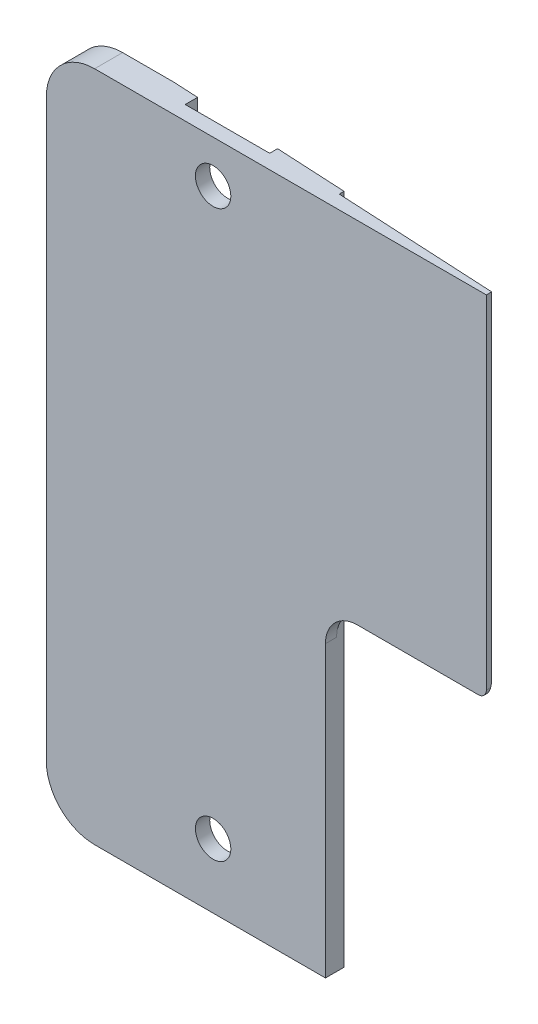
ISO-10303-21;
HEADER;
FILE_DESCRIPTION(('STEP AP214'),'2;1');
FILE_NAME('part.step','',(''),(''),'','','');
FILE_SCHEMA(('AUTOMOTIVE_DESIGN { 1 0 10303 214 1 1 1 1 }'));
ENDSEC;
DATA;
#1=APPLICATION_CONTEXT('core data for automotive mechanical design processes');
#2=APPLICATION_PROTOCOL_DEFINITION('international standard','automotive_design',2000,#1);
#3=PRODUCT_CONTEXT('',#1,'mechanical');
#4=PRODUCT('Part','Part','',(#3));
#5=PRODUCT_RELATED_PRODUCT_CATEGORY('part','',(#4));
#6=PRODUCT_DEFINITION_FORMATION('','',#4);
#7=PRODUCT_DEFINITION_CONTEXT('part definition',#1,'design');
#8=PRODUCT_DEFINITION('design','',#6,#7);
#9=PRODUCT_DEFINITION_SHAPE('','',#8);
#10=(LENGTH_UNIT() NAMED_UNIT(*) SI_UNIT(.MILLI.,.METRE.));
#11=(NAMED_UNIT(*) PLANE_ANGLE_UNIT() SI_UNIT($,.RADIAN.));
#12=(NAMED_UNIT(*) SI_UNIT($,.STERADIAN.) SOLID_ANGLE_UNIT());
#13=UNCERTAINTY_MEASURE_WITH_UNIT(LENGTH_MEASURE(1.E-05),#10,'distance_accuracy_value','');
#14=(GEOMETRIC_REPRESENTATION_CONTEXT(3) GLOBAL_UNCERTAINTY_ASSIGNED_CONTEXT((#13)) GLOBAL_UNIT_ASSIGNED_CONTEXT((#10,
#11,#12)) REPRESENTATION_CONTEXT('',''));
#15=CARTESIAN_POINT('',(0.,0.,0.));
#16=DIRECTION('',(0.,0.,1.));
#17=DIRECTION('',(1.,0.,0.));
#18=AXIS2_PLACEMENT_3D('',#15,#16,#17);
#19=CARTESIAN_POINT('',(0.,-128.652153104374,-6.7));
#20=DIRECTION('',(0.,0.,-1.));
#21=DIRECTION('',(-1.,0.,0.));
#22=AXIS2_PLACEMENT_3D('',#19,#20,#21);
#23=PLANE('',#22);
#24=CARTESIAN_POINT('',(4.64896534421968,-57.3698033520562,-6.7));
#25=DIRECTION('',(0.,0.,1.));
#26=DIRECTION('',(1.,0.,0.));
#27=AXIS2_PLACEMENT_3D('',#24,#25,#26);
#28=CIRCLE('',#27,3.);
#29=CARTESIAN_POINT('',(4.64896534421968,-54.3698033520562,-6.7));
#30=VERTEX_POINT('',#29);
#31=CARTESIAN_POINT('',(1.64896534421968,-57.3698033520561,-6.7));
#32=VERTEX_POINT('',#31);
#33=EDGE_CURVE('E211',#30,#32,#28,.T.);
#34=ORIENTED_EDGE('',*,*,#33,.F.);
#35=DIRECTION('',(-1.,0.,0.));
#36=VECTOR('',#35,1.);
#37=CARTESIAN_POINT('',(4.64896534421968,-54.3698033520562,-6.7));
#38=LINE('',#37,#36);
#39=CARTESIAN_POINT('',(7.83491967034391,-54.3698033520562,-6.70000000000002));
#40=VERTEX_POINT('',#39);
#41=EDGE_CURVE('E222',#40,#30,#38,.T.);
#42=ORIENTED_EDGE('',*,*,#41,.F.);
#43=DIRECTION('',(0.,1.,0.));
#44=VECTOR('',#43,1.);
#45=CARTESIAN_POINT('',(7.8349196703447,-128.652153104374,-6.7));
#46=LINE('',#45,#44);
#47=CARTESIAN_POINT('',(7.83491967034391,-96.145,-6.70000000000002));
#48=VERTEX_POINT('',#47);
#49=EDGE_CURVE('E254',#48,#40,#46,.T.);
#50=ORIENTED_EDGE('',*,*,#49,.F.);
#51=DIRECTION('',(1.,0.,0.));
#52=VECTOR('',#51,1.);
#53=CARTESIAN_POINT('',(4.64896534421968,-96.145,-6.7));
#54=LINE('',#53,#52);
#55=CARTESIAN_POINT('',(4.64896534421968,-96.145,-6.7));
#56=VERTEX_POINT('',#55);
#57=EDGE_CURVE('E220',#56,#48,#54,.T.);
#58=ORIENTED_EDGE('',*,*,#57,.F.);
#59=CARTESIAN_POINT('',(4.64896534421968,-93.145,-6.7));
#60=DIRECTION('',(0.,0.,1.));
#61=DIRECTION('',(-1.,0.,0.));
#62=AXIS2_PLACEMENT_3D('',#59,#60,#61);
#63=CIRCLE('',#62,3.);
#64=CARTESIAN_POINT('',(1.64896534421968,-93.145,-6.7));
#65=VERTEX_POINT('',#64);
#66=EDGE_CURVE('E217',#65,#56,#63,.T.);
#67=ORIENTED_EDGE('',*,*,#66,.F.);
#68=DIRECTION('',(0.,-1.,0.));
#69=VECTOR('',#68,1.);
#70=CARTESIAN_POINT('',(1.64896534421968,-93.145,-6.7));
#71=LINE('',#70,#69);
#72=EDGE_CURVE('E214',#32,#65,#71,.T.);
#73=ORIENTED_EDGE('',*,*,#72,.F.);
#74=EDGE_LOOP('',(#34,#42,#50,#58,#67,#73));
#75=FACE_BOUND('',#74,.T.);
#76=ADVANCED_FACE('F46',(#75),#23,.T.);
#77=CARTESIAN_POINT('',(19.,-128.652153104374,-6.11486293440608));
#78=DIRECTION('',(0.0523359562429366,0.,-0.998629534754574));
#79=DIRECTION('',(-0.998629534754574,0.,-0.0523359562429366));
#80=AXIS2_PLACEMENT_3D('',#77,#78,#79);
#81=PLANE('',#80);
#82=CARTESIAN_POINT('',(12.015,-92.145,-6.48093127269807));
#83=DIRECTION('',(0.0523359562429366,0.,-0.998629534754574));
#84=DIRECTION('',(-0.998629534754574,0.,-0.0523359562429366));
#85=AXIS2_PLACEMENT_3D('',#82,#83,#84);
#86=ELLIPSE('',#85,2.62860240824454,2.625);
#87=CARTESIAN_POINT('',(9.39000000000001,-92.145,-6.61850169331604));
#88=VERTEX_POINT('',#87);
#89=EDGE_CURVE('E210',#88,#88,#86,.T.);
#90=ORIENTED_EDGE('',*,*,#89,.F.);
#91=EDGE_LOOP('',(#90));
#92=FACE_BOUND('',#91,.T.);
#93=DIRECTION('',(0.,-1.,0.));
#94=VECTOR('',#93,1.);
#95=CARTESIAN_POINT('',(14.64,-128.652153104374,-6.34336085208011));
#96=LINE('',#95,#94);
#97=CARTESIAN_POINT('',(14.64,-54.3698033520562,-6.34336085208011));
#98=VERTEX_POINT('',#97);
#99=CARTESIAN_POINT('',(14.64,-57.,-6.34336085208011));
#100=VERTEX_POINT('',#99);
#101=EDGE_CURVE('E208',#98,#100,#96,.T.);
#102=ORIENTED_EDGE('',*,*,#101,.F.);
#103=DIRECTION('',(0.998629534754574,0.,0.0523359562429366));
#104=VECTOR('',#103,1.);
#105=CARTESIAN_POINT('',(19.,-54.3698033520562,-6.11486293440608));
#106=LINE('',#105,#104);
#107=CARTESIAN_POINT('',(19.,-54.3698033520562,-6.11486293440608));
#108=VERTEX_POINT('',#107);
#109=EDGE_CURVE('E249',#98,#108,#106,.T.);
#110=ORIENTED_EDGE('',*,*,#109,.T.);
#111=DIRECTION('',(0.,1.,0.));
#112=VECTOR('',#111,1.);
#113=CARTESIAN_POINT('',(19.,-128.652153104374,-6.11486293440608));
#114=LINE('',#113,#112);
#115=CARTESIAN_POINT('',(19.,-96.145,-6.11486293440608));
#116=VERTEX_POINT('',#115);
#117=EDGE_CURVE('E258',#116,#108,#114,.T.);
#118=ORIENTED_EDGE('',*,*,#117,.F.);
#119=DIRECTION('',(-0.998629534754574,0.,-0.0523359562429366));
#120=VECTOR('',#119,1.);
#121=CARTESIAN_POINT('',(19.,-96.145,-6.11486293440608));
#122=LINE('',#121,#120);
#123=EDGE_CURVE('E228',#116,#48,#122,.T.);
#124=ORIENTED_EDGE('',*,*,#123,.T.);
#125=ORIENTED_EDGE('',*,*,#49,.T.);
#126=CARTESIAN_POINT('',(9.39000000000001,-54.3698033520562,-6.61850169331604));
#127=VERTEX_POINT('',#126);
#128=EDGE_CURVE('E250',#40,#127,#106,.T.);
#129=ORIENTED_EDGE('',*,*,#128,.T.);
#130=DIRECTION('',(0.,1.,0.));
#131=VECTOR('',#130,1.);
#132=CARTESIAN_POINT('',(9.39000000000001,-128.652153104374,-6.61850169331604));
#133=LINE('',#132,#131);
#134=CARTESIAN_POINT('',(9.39000000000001,-57.,-6.61850169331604));
#135=VERTEX_POINT('',#134);
#136=EDGE_CURVE('E206',#135,#127,#133,.T.);
#137=ORIENTED_EDGE('',*,*,#136,.F.);
#138=CARTESIAN_POINT('',(12.015,-57.,-6.48093127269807));
#139=DIRECTION('',(0.0523359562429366,0.,-0.998629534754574));
#140=DIRECTION('',(-0.998629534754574,0.,-0.0523359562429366));
#141=AXIS2_PLACEMENT_3D('',#138,#139,#140);
#142=ELLIPSE('',#141,2.62860240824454,2.625);
#143=EDGE_CURVE('E174',#100,#135,#142,.T.);
#144=ORIENTED_EDGE('',*,*,#143,.F.);
#145=EDGE_LOOP('',(#102,#110,#118,#124,#125,#129,#137,#144));
#146=FACE_BOUND('',#145,.T.);
#147=ADVANCED_FACE('F397',(#92,#146),#81,.T.);
#148=CARTESIAN_POINT('',(19.,-128.652153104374,-6.11486293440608));
#149=DIRECTION('',(1.,0.,0.));
#150=DIRECTION('',(0.,0.,-1.));
#151=AXIS2_PLACEMENT_3D('',#148,#149,#150);
#152=PLANE('',#151);
#153=DIRECTION('',(0.,1.,0.));
#154=VECTOR('',#153,1.);
#155=CARTESIAN_POINT('',(19.,-128.652153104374,-5.81445123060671));
#156=LINE('',#155,#154);
#157=CARTESIAN_POINT('',(19.,-76.2739600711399,-5.81445123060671));
#158=VERTEX_POINT('',#157);
#159=CARTESIAN_POINT('',(19.,-54.3698033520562,-5.81445123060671));
#160=VERTEX_POINT('',#159);
#161=EDGE_CURVE('E261',#158,#160,#156,.T.);
#162=ORIENTED_EDGE('',*,*,#161,.F.);
#163=CARTESIAN_POINT('',(19.,-78.1450000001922,-5.65329520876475));
#164=CARTESIAN_POINT('',(19.0000017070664,-78.1188909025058,-5.65329499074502));
#165=CARTESIAN_POINT('',(19.0000035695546,-78.0927818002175,-5.65339661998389));
#166=CARTESIAN_POINT('',(19.0000057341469,-78.0405902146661,-5.65380355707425));
#167=CARTESIAN_POINT('',(19.0000060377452,-78.0145077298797,-5.654108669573));
#168=CARTESIAN_POINT('',(19.0000032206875,-77.9622888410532,-5.65492344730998));
#169=CARTESIAN_POINT('',(19.0000000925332,-77.9361524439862,-5.65543355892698));
#170=CARTESIAN_POINT('',(18.9999999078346,-77.8839882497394,-5.65665303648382));
#171=CARTESIAN_POINT('',(19.0000028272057,-77.8579604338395,-5.65736160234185));
#172=CARTESIAN_POINT('',(19.0000055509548,-77.8058697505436,-5.65898095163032));
#173=CARTESIAN_POINT('',(19.0000053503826,-77.7798068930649,-5.65989205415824));
#174=CARTESIAN_POINT('',(19.0000026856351,-77.7275737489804,-5.66191843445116));
#175=CARTESIAN_POINT('',(19.0000002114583,-77.7014034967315,-5.66303459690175));
#176=CARTESIAN_POINT('',(18.9999997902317,-77.6492813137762,-5.66545509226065));
#177=CARTESIAN_POINT('',(19.0000018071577,-77.623329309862,-5.666757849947));
#178=CARTESIAN_POINT('',(19.0000036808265,-77.5713316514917,-5.66956289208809));
#179=CARTESIAN_POINT('',(19.0000035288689,-77.5452860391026,-5.67106595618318));
#180=CARTESIAN_POINT('',(19.0000017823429,-77.4930425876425,-5.67427462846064));
#181=CARTESIAN_POINT('',(19.0000001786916,-77.4668448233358,-5.67598145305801));
#182=CARTESIAN_POINT('',(18.9999998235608,-77.4147925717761,-5.679563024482));
#183=CARTESIAN_POINT('',(19.0000010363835,-77.3889379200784,-5.68143538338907));
#184=CARTESIAN_POINT('',(19.0000021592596,-77.3370660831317,-5.68537662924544));
#185=CARTESIAN_POINT('',(19.000002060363,-77.3110489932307,-5.68744677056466));
#186=CARTESIAN_POINT('',(19.0000010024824,-77.258808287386,-5.69178693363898));
#187=CARTESIAN_POINT('',(19.0000000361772,-77.2325848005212,-5.69405850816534));
#188=CARTESIAN_POINT('',(18.9999999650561,-77.181047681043,-5.69870066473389));
#189=CARTESIAN_POINT('',(19.000000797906,-77.1557335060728,-5.70106523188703));
#190=CARTESIAN_POINT('',(19.000002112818,-77.1048872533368,-5.70598040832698));
#191=CARTESIAN_POINT('',(19.0000025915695,-77.0793553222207,-5.70853253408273));
#192=CARTESIAN_POINT('',(19.000002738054,-77.0280438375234,-5.71382583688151));
#193=CARTESIAN_POINT('',(19.0000023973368,-77.002264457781,-5.71656869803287));
#194=CARTESIAN_POINT('',(19.0000016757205,-76.9504309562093,-5.72224637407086));
#195=CARTESIAN_POINT('',(19.0000012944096,-76.9243770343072,-5.72518301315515));
#196=CARTESIAN_POINT('',(19.0000006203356,-76.8719694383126,-5.73125112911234));
#197=CARTESIAN_POINT('',(19.0000003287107,-76.8456159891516,-5.73438454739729));
#198=CARTESIAN_POINT('',(19.0000002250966,-76.7925863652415,-5.7408488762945));
#199=CARTESIAN_POINT('',(19.0000004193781,-76.765910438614,-5.74418182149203));
#200=CARTESIAN_POINT('',(18.9999996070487,-76.7142586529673,-5.75078699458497));
#201=CARTESIAN_POINT('',(18.9999986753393,-76.6892815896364,-5.75404981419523));
#202=CARTESIAN_POINT('',(18.999996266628,-76.6389958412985,-5.76075217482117));
#203=CARTESIAN_POINT('',(18.9999947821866,-76.6136874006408,-5.76419354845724));
#204=CARTESIAN_POINT('',(18.9999927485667,-76.5627247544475,-5.77125482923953));
#205=CARTESIAN_POINT('',(18.9999922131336,-76.5370708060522,-5.77487659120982));
#206=CARTESIAN_POINT('',(18.9999922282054,-76.48540435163,-5.78230053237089));
#207=CARTESIAN_POINT('',(18.9999927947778,-76.4593921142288,-5.78610458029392));
#208=CARTESIAN_POINT('',(18.999994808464,-76.4069978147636,-5.79389484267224));
#209=CARTESIAN_POINT('',(18.9999962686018,-76.380616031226,-5.7978829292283));
#210=CARTESIAN_POINT('',(18.9999987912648,-76.3274728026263,-5.80604303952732));
#211=CARTESIAN_POINT('',(18.9999998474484,-76.3007116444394,-5.81021693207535));
#212=CARTESIAN_POINT('',(19.0000000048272,-76.2739600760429,-5.81445123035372));
#213=B_SPLINE_CURVE_WITH_KNOTS('',3,(#163,#164,#165,#166,#167,#168,#169,#170,#171,#172,#173,
#174,#175,#176,#177,#178,#179,#180,#181,#182,#183,#184,#185,#186,#187,#188,#189,#190,#191,#192,
#193,#194,#195,#196,#197,#198,#199,#200,#201,#202,#203,#204,#205,#206,#207,#208,#209,#210,#211,
#212),.UNSPECIFIED.,.F.,.F.,(4,2,2,2,2,2,2,2,2,2,2,2,2,2,2,2,2,2,2,2,2,2,2,2,4),(0.,
0.0783271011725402,0.156579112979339,0.235002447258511,0.313114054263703,0.391349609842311,
0.469930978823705,0.547884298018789,0.626150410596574,0.704909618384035,0.782676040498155,
0.860973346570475,0.939937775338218,1.0162103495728,1.0931873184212,1.17096146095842,
1.24961765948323,1.32923440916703,1.40988393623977,1.48545141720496,1.5620751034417,
1.63979980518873,1.71866624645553,1.79871050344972,1.87996428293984),.UNSPECIFIED.);
#214=CARTESIAN_POINT('',(19.,-78.145,-5.65329446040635));
#215=VERTEX_POINT('',#214);
#216=EDGE_CURVE('E334',#158,#215,#213,.F.);
#217=ORIENTED_EDGE('',*,*,#216,.T.);
#218=DIRECTION('',(0.,0.,1.));
#219=VECTOR('',#218,1.);
#220=CARTESIAN_POINT('',(19.,-78.145,-4.96));
#221=LINE('',#220,#219);
#222=CARTESIAN_POINT('',(19.,-78.145,-4.96));
#223=VERTEX_POINT('',#222);
#224=EDGE_CURVE('E494',#215,#223,#221,.T.);
#225=ORIENTED_EDGE('',*,*,#224,.T.);
#226=DIRECTION('',(0.,1.,0.));
#227=VECTOR('',#226,1.);
#228=CARTESIAN_POINT('',(19.,-128.652153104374,-4.96));
#229=LINE('',#228,#227);
#230=CARTESIAN_POINT('',(19.,-96.145,-4.96));
#231=VERTEX_POINT('',#230);
#232=EDGE_CURVE('E482',#231,#223,#229,.T.);
#233=ORIENTED_EDGE('',*,*,#232,.F.);
#234=DIRECTION('',(0.,0.,1.));
#235=VECTOR('',#234,1.);
#236=CARTESIAN_POINT('',(19.,-96.145,-6.7));
#237=LINE('',#236,#235);
#238=EDGE_CURVE('E232',#116,#231,#237,.T.);
#239=ORIENTED_EDGE('',*,*,#238,.F.);
#240=ORIENTED_EDGE('',*,*,#117,.T.);
#241=DIRECTION('',(0.,0.,1.));
#242=VECTOR('',#241,1.);
#243=CARTESIAN_POINT('',(19.,-54.3698033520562,-6.11486293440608));
#244=LINE('',#243,#242);
#245=EDGE_CURVE('E246',#108,#160,#244,.T.);
#246=ORIENTED_EDGE('',*,*,#245,.T.);
#247=EDGE_LOOP('',(#162,#217,#225,#233,#239,#240,#246));
#248=FACE_BOUND('',#247,.T.);
#249=ADVANCED_FACE('F294',(#248),#152,.T.);
#250=CARTESIAN_POINT('',(19.,-128.652153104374,-5.81445123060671));
#251=DIRECTION('',(0.0523359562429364,0.,-0.998629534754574));
#252=DIRECTION('',(-0.998629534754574,0.,-0.0523359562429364));
#253=AXIS2_PLACEMENT_3D('',#250,#251,#252);
#254=PLANE('',#253);
#255=DIRECTION('',(-0.998629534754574,0.,-0.0523359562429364));
#256=VECTOR('',#255,1.);
#257=CARTESIAN_POINT('',(19.,-75.3985898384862,-5.81445123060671));
#258=LINE('',#257,#256);
#259=CARTESIAN_POINT('',(29.,-75.3985898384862,-5.29037343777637));
#260=VERTEX_POINT('',#259);
#261=CARTESIAN_POINT('',(21.0104671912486,-75.3985898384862,-5.70908710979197));
#262=VERTEX_POINT('',#261);
#263=EDGE_CURVE('E281',#260,#262,#258,.T.);
#264=ORIENTED_EDGE('',*,*,#263,.T.);
#265=CARTESIAN_POINT('',(18.2725232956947,-78.3604808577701,-5.85257666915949));
#266=CARTESIAN_POINT('',(18.2577001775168,-78.172322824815,-5.85335351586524));
#267=CARTESIAN_POINT('',(18.2623719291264,-77.9826397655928,-5.85310867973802));
#268=CARTESIAN_POINT('',(18.2984056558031,-77.701831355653,-5.8512202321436));
#269=CARTESIAN_POINT('',(18.3152460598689,-77.6088493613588,-5.85033766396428));
#270=CARTESIAN_POINT('',(18.358405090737,-77.4251103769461,-5.84807579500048));
#271=CARTESIAN_POINT('',(18.3847238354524,-77.3343544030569,-5.84669648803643));
#272=CARTESIAN_POINT('',(18.4465606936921,-77.1560318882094,-5.84345575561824));
#273=CARTESIAN_POINT('',(18.482078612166,-77.068465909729,-5.84159434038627));
#274=CARTESIAN_POINT('',(18.5619367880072,-76.8974530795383,-5.83740915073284));
#275=CARTESIAN_POINT('',(18.60627679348,-76.8140067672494,-5.83508538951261));
#276=CARTESIAN_POINT('',(18.7033084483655,-76.6521192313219,-5.83000017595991));
#277=CARTESIAN_POINT('',(18.7559997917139,-76.5736785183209,-5.82723873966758));
#278=CARTESIAN_POINT('',(18.869174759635,-76.4226350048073,-5.8213074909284));
#279=CARTESIAN_POINT('',(18.929658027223,-76.3500326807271,-5.81813769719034));
#280=CARTESIAN_POINT('',(19.0577747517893,-76.2114367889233,-5.8114233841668));
#281=CARTESIAN_POINT('',(19.1254078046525,-76.145443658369,-5.80787888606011));
#282=CARTESIAN_POINT('',(19.2671060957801,-76.0207668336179,-5.80045279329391));
#283=CARTESIAN_POINT('',(19.3411708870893,-75.9620835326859,-5.79657122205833));
#284=CARTESIAN_POINT('',(19.4949463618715,-75.8526494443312,-5.78851219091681));
#285=CARTESIAN_POINT('',(19.5746565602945,-75.8018990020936,-5.78433475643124));
#286=CARTESIAN_POINT('',(19.7388766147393,-75.7088694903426,-5.77572834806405));
#287=CARTESIAN_POINT('',(19.8233859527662,-75.6665907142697,-5.77129940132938));
#288=CARTESIAN_POINT('',(19.9963070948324,-75.5909534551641,-5.76223698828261));
#289=CARTESIAN_POINT('',(20.0847183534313,-75.557595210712,-5.75760355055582));
#290=CARTESIAN_POINT('',(20.2645047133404,-75.5001532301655,-5.7481813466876));
#291=CARTESIAN_POINT('',(20.3558787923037,-75.4760694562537,-5.74339263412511));
#292=CARTESIAN_POINT('',(20.632994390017,-75.4181148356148,-5.72886962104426));
#293=CARTESIAN_POINT('',(20.8217261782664,-75.3985751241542,-5.71897860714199));
#294=CARTESIAN_POINT('',(21.0104671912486,-75.3985898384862,-5.70908710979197));
#295=B_SPLINE_CURVE_WITH_KNOTS('',3,(#265,#266,#267,#268,#269,#270,#271,#272,#273,#274,#275,
#276,#277,#278,#279,#280,#281,#282,#283,#284,#285,#286,#287,#288,#289,#290,#291,#292,#293,#294),
.UNSPECIFIED.,.F.,.F.,(4,2,2,2,2,2,2,2,2,2,2,2,2,2,4),(-0.0785398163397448,0.127627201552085,
0.230710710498,0.333794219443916,0.436877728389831,0.539961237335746,0.643044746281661,
0.746128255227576,0.849211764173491,0.952295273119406,1.05537878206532,1.15846229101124,
1.26154579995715,1.36462930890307,1.5707963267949),.UNSPECIFIED.);
#296=EDGE_CURVE('E275',#262,#158,#295,.F.);
#297=ORIENTED_EDGE('',*,*,#296,.T.);
#298=ORIENTED_EDGE('',*,*,#161,.T.);
#299=DIRECTION('',(0.998629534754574,0.,0.0523359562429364));
#300=VECTOR('',#299,1.);
#301=CARTESIAN_POINT('',(19.,-54.3698033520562,-5.81445123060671));
#302=LINE('',#301,#300);
#303=CARTESIAN_POINT('',(29.,-54.3698033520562,-5.29037343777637));
#304=VERTEX_POINT('',#303);
#305=EDGE_CURVE('E243',#160,#304,#302,.T.);
#306=ORIENTED_EDGE('',*,*,#305,.T.);
#307=DIRECTION('',(0.,1.,0.));
#308=VECTOR('',#307,1.);
#309=CARTESIAN_POINT('',(29.,-128.652153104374,-5.29037343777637));
#310=LINE('',#309,#308);
#311=EDGE_CURVE('E264',#260,#304,#310,.T.);
#312=ORIENTED_EDGE('',*,*,#311,.F.);
#313=EDGE_LOOP('',(#264,#297,#298,#306,#312));
#314=FACE_BOUND('',#313,.T.);
#315=ADVANCED_FACE('F283',(#314),#254,.T.);
#316=CARTESIAN_POINT('',(29.,-128.652153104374,-4.96));
#317=DIRECTION('',(1.,0.,0.));
#318=DIRECTION('',(0.,0.,-1.));
#319=AXIS2_PLACEMENT_3D('',#316,#317,#318);
#320=PLANE('',#319);
#321=DIRECTION('',(0.,1.,0.));
#322=VECTOR('',#321,1.);
#323=CARTESIAN_POINT('',(29.,-128.652153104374,-4.96));
#324=LINE('',#323,#322);
#325=CARTESIAN_POINT('',(29.,-75.645,-4.96));
#326=VERTEX_POINT('',#325);
#327=CARTESIAN_POINT('',(29.,-54.3698033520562,-4.96));
#328=VERTEX_POINT('',#327);
#329=EDGE_CURVE('E253',#326,#328,#324,.T.);
#330=ORIENTED_EDGE('',*,*,#329,.F.);
#331=DIRECTION('',(0.,0.,1.));
#332=VECTOR('',#331,1.);
#333=CARTESIAN_POINT('',(29.,-75.645,-4.96));
#334=LINE('',#333,#332);
#335=CARTESIAN_POINT('',(29.,-75.645,-5.22425742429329));
#336=VERTEX_POINT('',#335);
#337=EDGE_CURVE('E54',#326,#336,#334,.F.);
#338=ORIENTED_EDGE('',*,*,#337,.T.);
#339=DIRECTION('',(0.,-0.965836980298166,0.259150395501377));
#340=VECTOR('',#339,1.);
#341=CARTESIAN_POINT('',(29.,-125.158392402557,8.0610230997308));
#342=LINE('',#341,#340);
#343=EDGE_CURVE('E329',#336,#260,#342,.F.);
#344=ORIENTED_EDGE('',*,*,#343,.T.);
#345=ORIENTED_EDGE('',*,*,#311,.T.);
#346=DIRECTION('',(0.,0.,1.));
#347=VECTOR('',#346,1.);
#348=CARTESIAN_POINT('',(29.,-54.3698033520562,-6.7));
#349=LINE('',#348,#347);
#350=EDGE_CURVE('E229',#304,#328,#349,.T.);
#351=ORIENTED_EDGE('',*,*,#350,.T.);
#352=EDGE_LOOP('',(#330,#338,#344,#345,#351));
#353=FACE_BOUND('',#352,.T.);
#354=ADVANCED_FACE('F293',(#353),#320,.T.);
#355=CARTESIAN_POINT('',(0.,-128.652153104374,-4.96));
#356=DIRECTION('',(0.,0.,1.));
#357=DIRECTION('',(1.,0.,0.));
#358=AXIS2_PLACEMENT_3D('',#355,#356,#357);
#359=PLANE('',#358);
#360=CARTESIAN_POINT('',(12.015,-57.,-4.96));
#361=DIRECTION('',(0.,0.,-1.));
#362=DIRECTION('',(-1.,0.,0.));
#363=AXIS2_PLACEMENT_3D('',#360,#361,#362);
#364=CIRCLE('',#363,1.1);
#365=CARTESIAN_POINT('',(10.915,-57.,-4.96));
#366=VERTEX_POINT('',#365);
#367=EDGE_CURVE('E190',#366,#366,#364,.T.);
#368=ORIENTED_EDGE('',*,*,#367,.T.);
#369=EDGE_LOOP('',(#368));
#370=FACE_BOUND('',#369,.T.);
#371=CARTESIAN_POINT('',(12.015,-92.145,-4.96));
#372=DIRECTION('',(0.,0.,-1.));
#373=DIRECTION('',(-1.,0.,0.));
#374=AXIS2_PLACEMENT_3D('',#371,#372,#373);
#375=CIRCLE('',#374,1.1);
#376=CARTESIAN_POINT('',(10.915,-92.145,-4.96));
#377=VERTEX_POINT('',#376);
#378=EDGE_CURVE('E460',#377,#377,#375,.T.);
#379=ORIENTED_EDGE('',*,*,#378,.T.);
#380=EDGE_LOOP('',(#379));
#381=FACE_BOUND('',#380,.T.);
#382=DIRECTION('',(1.,0.,0.));
#383=VECTOR('',#382,1.);
#384=CARTESIAN_POINT('',(0.,-76.145,-4.96));
#385=LINE('',#384,#383);
#386=CARTESIAN_POINT('',(21.,-76.145,-4.96));
#387=VERTEX_POINT('',#386);
#388=CARTESIAN_POINT('',(28.5,-76.145,-4.96));
#389=VERTEX_POINT('',#388);
#390=EDGE_CURVE('E475',#387,#389,#385,.T.);
#391=ORIENTED_EDGE('',*,*,#390,.T.);
#392=CARTESIAN_POINT('',(28.5,-75.645,-4.96));
#393=DIRECTION('',(0.,0.,1.));
#394=DIRECTION('',(1.,0.,0.));
#395=AXIS2_PLACEMENT_3D('',#392,#393,#394);
#396=CIRCLE('',#395,0.5);
#397=EDGE_CURVE('E68',#389,#326,#396,.T.);
#398=ORIENTED_EDGE('',*,*,#397,.T.);
#399=ORIENTED_EDGE('',*,*,#329,.T.);
#400=DIRECTION('',(-1.,0.,0.));
#401=VECTOR('',#400,1.);
#402=CARTESIAN_POINT('',(0.,-54.3698033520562,-4.96));
#403=LINE('',#402,#401);
#404=CARTESIAN_POINT('',(4.64896534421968,-54.3698033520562,-4.96));
#405=VERTEX_POINT('',#404);
#406=EDGE_CURVE('E485',#328,#405,#403,.T.);
#407=ORIENTED_EDGE('',*,*,#406,.T.);
#408=CARTESIAN_POINT('',(4.64896534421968,-57.3698033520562,-4.96));
#409=DIRECTION('',(0.,0.,1.));
#410=DIRECTION('',(1.,0.,0.));
#411=AXIS2_PLACEMENT_3D('',#408,#409,#410);
#412=CIRCLE('',#411,3.);
#413=CARTESIAN_POINT('',(1.64896534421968,-57.3698033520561,-4.96));
#414=VERTEX_POINT('',#413);
#415=EDGE_CURVE('E481',#405,#414,#412,.T.);
#416=ORIENTED_EDGE('',*,*,#415,.T.);
#417=DIRECTION('',(0.,-1.,0.));
#418=VECTOR('',#417,1.);
#419=CARTESIAN_POINT('',(1.64896534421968,-128.652153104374,-4.96));
#420=LINE('',#419,#418);
#421=CARTESIAN_POINT('',(1.64896534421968,-93.145,-4.96));
#422=VERTEX_POINT('',#421);
#423=EDGE_CURVE('E257',#414,#422,#420,.T.);
#424=ORIENTED_EDGE('',*,*,#423,.T.);
#425=CARTESIAN_POINT('',(4.64896534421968,-93.145,-4.96));
#426=DIRECTION('',(0.,0.,1.));
#427=DIRECTION('',(1.,0.,0.));
#428=AXIS2_PLACEMENT_3D('',#425,#426,#427);
#429=CIRCLE('',#428,3.);
#430=CARTESIAN_POINT('',(4.64896534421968,-96.145,-4.96));
#431=VERTEX_POINT('',#430);
#432=EDGE_CURVE('E510',#422,#431,#429,.T.);
#433=ORIENTED_EDGE('',*,*,#432,.T.);
#434=DIRECTION('',(1.,0.,0.));
#435=VECTOR('',#434,1.);
#436=CARTESIAN_POINT('',(0.,-96.145,-4.96));
#437=LINE('',#436,#435);
#438=EDGE_CURVE('E487',#431,#231,#437,.T.);
#439=ORIENTED_EDGE('',*,*,#438,.T.);
#440=ORIENTED_EDGE('',*,*,#232,.T.);
#441=CARTESIAN_POINT('',(21.,-78.145,-4.96));
#442=DIRECTION('',(0.,0.,1.));
#443=DIRECTION('',(1.,0.,0.));
#444=AXIS2_PLACEMENT_3D('',#441,#442,#443);
#445=CIRCLE('',#444,2.);
#446=EDGE_CURVE('E269',#223,#387,#445,.F.);
#447=ORIENTED_EDGE('',*,*,#446,.T.);
#448=EDGE_LOOP('',(#391,#398,#399,#407,#416,#424,#433,#439,#440,#447));
#449=FACE_BOUND('',#448,.T.);
#450=ADVANCED_FACE('F299',(#370,#381,#449),#359,.T.);
#451=CARTESIAN_POINT('',(4.64896534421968,-57.3698033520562,-6.7));
#452=DIRECTION('',(0.,0.,1.));
#453=DIRECTION('',(1.,0.,0.));
#454=AXIS2_PLACEMENT_3D('',#451,#452,#453);
#455=CYLINDRICAL_SURFACE('',#454,3.);
#456=DIRECTION('',(0.,0.,1.));
#457=VECTOR('',#456,1.);
#458=CARTESIAN_POINT('',(4.64896534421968,-54.3698033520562,-6.7));
#459=LINE('',#458,#457);
#460=EDGE_CURVE('E225',#30,#405,#459,.T.);
#461=ORIENTED_EDGE('',*,*,#460,.F.);
#462=ORIENTED_EDGE('',*,*,#33,.T.);
#463=DIRECTION('',(0.,0.,1.));
#464=VECTOR('',#463,1.);
#465=CARTESIAN_POINT('',(1.64896534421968,-57.3698033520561,-6.7));
#466=LINE('',#465,#464);
#467=EDGE_CURVE('E224',#32,#414,#466,.T.);
#468=ORIENTED_EDGE('',*,*,#467,.T.);
#469=ORIENTED_EDGE('',*,*,#415,.F.);
#470=EDGE_LOOP('',(#461,#462,#468,#469));
#471=FACE_BOUND('',#470,.T.);
#472=ADVANCED_FACE('F302',(#471),#455,.T.);
#473=CARTESIAN_POINT('',(4.64896534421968,-54.3698033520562,-6.7));
#474=DIRECTION('',(0.,1.,0.));
#475=DIRECTION('',(0.,0.,1.));
#476=AXIS2_PLACEMENT_3D('',#473,#474,#475);
#477=PLANE('',#476);
#478=DIRECTION('',(0.,0.,-1.));
#479=VECTOR('',#478,1.);
#480=CARTESIAN_POINT('',(14.64,-54.3698033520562,-5.85));
#481=LINE('',#480,#479);
#482=CARTESIAN_POINT('',(14.64,-54.3698033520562,-5.85));
#483=VERTEX_POINT('',#482);
#484=EDGE_CURVE('E203',#483,#98,#481,.T.);
#485=ORIENTED_EDGE('',*,*,#484,.F.);
#486=DIRECTION('',(1.,0.,0.));
#487=VECTOR('',#486,1.);
#488=CARTESIAN_POINT('',(9.39000000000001,-54.3698033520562,-5.85));
#489=LINE('',#488,#487);
#490=CARTESIAN_POINT('',(9.39000000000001,-54.3698033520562,-5.85));
#491=VERTEX_POINT('',#490);
#492=EDGE_CURVE('E186',#491,#483,#489,.T.);
#493=ORIENTED_EDGE('',*,*,#492,.F.);
#494=DIRECTION('',(0.,0.,-1.));
#495=VECTOR('',#494,1.);
#496=CARTESIAN_POINT('',(9.39000000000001,-54.3698033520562,-5.85));
#497=LINE('',#496,#495);
#498=EDGE_CURVE('E177',#491,#127,#497,.T.);
#499=ORIENTED_EDGE('',*,*,#498,.T.);
#500=ORIENTED_EDGE('',*,*,#128,.F.);
#501=ORIENTED_EDGE('',*,*,#41,.T.);
#502=ORIENTED_EDGE('',*,*,#460,.T.);
#503=ORIENTED_EDGE('',*,*,#406,.F.);
#504=ORIENTED_EDGE('',*,*,#350,.F.);
#505=ORIENTED_EDGE('',*,*,#305,.F.);
#506=ORIENTED_EDGE('',*,*,#245,.F.);
#507=ORIENTED_EDGE('',*,*,#109,.F.);
#508=EDGE_LOOP('',(#485,#493,#499,#500,#501,#502,#503,#504,#505,#506,#507));
#509=FACE_BOUND('',#508,.T.);
#510=ADVANCED_FACE('F408',(#509),#477,.T.);
#511=CARTESIAN_POINT('',(19.,-76.145,-6.7));
#512=DIRECTION('',(0.,-1.,0.));
#513=DIRECTION('',(0.,0.,-1.));
#514=AXIS2_PLACEMENT_3D('',#511,#512,#513);
#515=PLANE('',#514);
#516=DIRECTION('',(0.998629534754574,0.,0.0523359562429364));
#517=VECTOR('',#516,1.);
#518=CARTESIAN_POINT('',(18.9432502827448,-76.145,-5.6171508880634));
#519=LINE('',#518,#517);
#520=CARTESIAN_POINT('',(21.,-76.145,-5.50936120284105));
#521=VERTEX_POINT('',#520);
#522=CARTESIAN_POINT('',(28.5,-76.145,-5.1163028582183));
#523=VERTEX_POINT('',#522);
#524=EDGE_CURVE('E321',#521,#523,#519,.T.);
#525=ORIENTED_EDGE('',*,*,#524,.T.);
#526=DIRECTION('',(0.,0.,1.));
#527=VECTOR('',#526,1.);
#528=CARTESIAN_POINT('',(28.5,-76.145,-6.7));
#529=LINE('',#528,#527);
#530=EDGE_CURVE('E530',#523,#389,#529,.T.);
#531=ORIENTED_EDGE('',*,*,#530,.T.);
#532=ORIENTED_EDGE('',*,*,#390,.F.);
#533=DIRECTION('',(0.,0.,1.));
#534=VECTOR('',#533,1.);
#535=CARTESIAN_POINT('',(21.,-76.145,-5.81445123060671));
#536=LINE('',#535,#534);
#537=EDGE_CURVE('E500',#387,#521,#536,.F.);
#538=ORIENTED_EDGE('',*,*,#537,.T.);
#539=EDGE_LOOP('',(#525,#531,#532,#538));
#540=FACE_BOUND('',#539,.T.);
#541=ADVANCED_FACE('F421',(#540),#515,.T.);
#542=CARTESIAN_POINT('',(4.64896534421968,-96.145,-6.7));
#543=DIRECTION('',(0.,-1.,0.));
#544=DIRECTION('',(0.,0.,-1.));
#545=AXIS2_PLACEMENT_3D('',#542,#543,#544);
#546=PLANE('',#545);
#547=ORIENTED_EDGE('',*,*,#238,.T.);
#548=ORIENTED_EDGE('',*,*,#438,.F.);
#549=DIRECTION('',(0.,0.,1.));
#550=VECTOR('',#549,1.);
#551=CARTESIAN_POINT('',(4.64896534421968,-96.145,-6.7));
#552=LINE('',#551,#550);
#553=EDGE_CURVE('E234',#56,#431,#552,.T.);
#554=ORIENTED_EDGE('',*,*,#553,.F.);
#555=ORIENTED_EDGE('',*,*,#57,.T.);
#556=ORIENTED_EDGE('',*,*,#123,.F.);
#557=EDGE_LOOP('',(#547,#548,#554,#555,#556));
#558=FACE_BOUND('',#557,.T.);
#559=ADVANCED_FACE('F417',(#558),#546,.T.);
#560=CARTESIAN_POINT('',(4.64896534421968,-93.145,-6.7));
#561=DIRECTION('',(0.,0.,1.));
#562=DIRECTION('',(1.,0.,0.));
#563=AXIS2_PLACEMENT_3D('',#560,#561,#562);
#564=CYLINDRICAL_SURFACE('',#563,3.);
#565=DIRECTION('',(0.,0.,1.));
#566=VECTOR('',#565,1.);
#567=CARTESIAN_POINT('',(1.64896534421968,-93.145,-6.7));
#568=LINE('',#567,#566);
#569=EDGE_CURVE('E237',#65,#422,#568,.T.);
#570=ORIENTED_EDGE('',*,*,#569,.F.);
#571=ORIENTED_EDGE('',*,*,#66,.T.);
#572=ORIENTED_EDGE('',*,*,#553,.T.);
#573=ORIENTED_EDGE('',*,*,#432,.F.);
#574=EDGE_LOOP('',(#570,#571,#572,#573));
#575=FACE_BOUND('',#574,.T.);
#576=ADVANCED_FACE('F413',(#575),#564,.T.);
#577=CARTESIAN_POINT('',(1.64896534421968,-93.145,-6.7));
#578=DIRECTION('',(-1.,0.,0.));
#579=DIRECTION('',(0.,0.,1.));
#580=AXIS2_PLACEMENT_3D('',#577,#578,#579);
#581=PLANE('',#580);
#582=ORIENTED_EDGE('',*,*,#467,.F.);
#583=ORIENTED_EDGE('',*,*,#72,.T.);
#584=ORIENTED_EDGE('',*,*,#569,.T.);
#585=ORIENTED_EDGE('',*,*,#423,.F.);
#586=EDGE_LOOP('',(#582,#583,#584,#585));
#587=FACE_BOUND('',#586,.T.);
#588=ADVANCED_FACE('F410',(#587),#581,.T.);
#589=CARTESIAN_POINT('',(12.015,-57.,-5.85));
#590=DIRECTION('',(0.,0.,-1.));
#591=DIRECTION('',(-1.,0.,0.));
#592=AXIS2_PLACEMENT_3D('',#589,#590,#591);
#593=CYLINDRICAL_SURFACE('',#592,2.625);
#594=ORIENTED_EDGE('',*,*,#143,.T.);
#595=DIRECTION('',(0.,0.,-1.));
#596=VECTOR('',#595,1.);
#597=CARTESIAN_POINT('',(9.39000000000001,-57.,-5.85));
#598=LINE('',#597,#596);
#599=CARTESIAN_POINT('',(9.39000000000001,-57.,-5.85));
#600=VERTEX_POINT('',#599);
#601=EDGE_CURVE('E166',#600,#135,#598,.T.);
#602=ORIENTED_EDGE('',*,*,#601,.F.);
#603=CARTESIAN_POINT('',(12.015,-57.,-5.85));
#604=DIRECTION('',(0.,0.,-1.));
#605=DIRECTION('',(-1.,0.,0.));
#606=AXIS2_PLACEMENT_3D('',#603,#604,#605);
#607=CIRCLE('',#606,2.625);
#608=CARTESIAN_POINT('',(14.64,-57.,-5.85));
#609=VERTEX_POINT('',#608);
#610=EDGE_CURVE('E171',#609,#600,#607,.T.);
#611=ORIENTED_EDGE('',*,*,#610,.F.);
#612=DIRECTION('',(0.,0.,-1.));
#613=VECTOR('',#612,1.);
#614=CARTESIAN_POINT('',(14.64,-57.,-5.85));
#615=LINE('',#614,#613);
#616=EDGE_CURVE('E201',#609,#100,#615,.T.);
#617=ORIENTED_EDGE('',*,*,#616,.T.);
#618=EDGE_LOOP('',(#594,#602,#611,#617));
#619=FACE_BOUND('',#618,.T.);
#620=ADVANCED_FACE('F168',(#619),#593,.F.);
#621=CARTESIAN_POINT('',(14.64,-57.,-5.85));
#622=DIRECTION('',(1.,0.,0.));
#623=DIRECTION('',(0.,0.,-1.));
#624=AXIS2_PLACEMENT_3D('',#621,#622,#623);
#625=PLANE('',#624);
#626=ORIENTED_EDGE('',*,*,#101,.T.);
#627=ORIENTED_EDGE('',*,*,#616,.F.);
#628=DIRECTION('',(0.,-1.,0.));
#629=VECTOR('',#628,1.);
#630=CARTESIAN_POINT('',(14.64,-57.,-5.85));
#631=LINE('',#630,#629);
#632=EDGE_CURVE('E178',#483,#609,#631,.T.);
#633=ORIENTED_EDGE('',*,*,#632,.F.);
#634=ORIENTED_EDGE('',*,*,#484,.T.);
#635=EDGE_LOOP('',(#626,#627,#633,#634));
#636=FACE_BOUND('',#635,.T.);
#637=ADVANCED_FACE('F431',(#636),#625,.F.);
#638=CARTESIAN_POINT('',(9.39000000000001,-57.,-5.85));
#639=DIRECTION('',(-1.,0.,0.));
#640=DIRECTION('',(0.,0.,1.));
#641=AXIS2_PLACEMENT_3D('',#638,#639,#640);
#642=PLANE('',#641);
#643=ORIENTED_EDGE('',*,*,#136,.T.);
#644=ORIENTED_EDGE('',*,*,#498,.F.);
#645=DIRECTION('',(0.,1.,0.));
#646=VECTOR('',#645,1.);
#647=CARTESIAN_POINT('',(9.39000000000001,-57.,-5.85));
#648=LINE('',#647,#646);
#649=EDGE_CURVE('E181',#600,#491,#648,.T.);
#650=ORIENTED_EDGE('',*,*,#649,.F.);
#651=ORIENTED_EDGE('',*,*,#601,.T.);
#652=EDGE_LOOP('',(#643,#644,#650,#651));
#653=FACE_BOUND('',#652,.T.);
#654=ADVANCED_FACE('F182',(#653),#642,.F.);
#655=CARTESIAN_POINT('',(12.015,-57.,-5.85));
#656=DIRECTION('',(0.,0.,-1.));
#657=DIRECTION('',(-1.,0.,0.));
#658=AXIS2_PLACEMENT_3D('',#655,#656,#657);
#659=PLANE('',#658);
#660=CARTESIAN_POINT('',(12.015,-57.,-5.85));
#661=DIRECTION('',(0.,0.,-1.));
#662=DIRECTION('',(-1.,0.,0.));
#663=AXIS2_PLACEMENT_3D('',#660,#661,#662);
#664=CIRCLE('',#663,1.1);
#665=CARTESIAN_POINT('',(10.915,-57.,-5.85));
#666=VERTEX_POINT('',#665);
#667=EDGE_CURVE('E193',#666,#666,#664,.T.);
#668=ORIENTED_EDGE('',*,*,#667,.F.);
#669=EDGE_LOOP('',(#668));
#670=FACE_BOUND('',#669,.T.);
#671=ORIENTED_EDGE('',*,*,#610,.T.);
#672=ORIENTED_EDGE('',*,*,#649,.T.);
#673=ORIENTED_EDGE('',*,*,#492,.T.);
#674=ORIENTED_EDGE('',*,*,#632,.T.);
#675=EDGE_LOOP('',(#671,#672,#673,#674));
#676=FACE_BOUND('',#675,.T.);
#677=ADVANCED_FACE('F188',(#670,#676),#659,.T.);
#678=CARTESIAN_POINT('',(12.015,-92.145,-5.85));
#679=DIRECTION('',(0.,0.,-1.));
#680=DIRECTION('',(-1.,0.,0.));
#681=AXIS2_PLACEMENT_3D('',#678,#679,#680);
#682=CYLINDRICAL_SURFACE('',#681,2.625);
#683=ORIENTED_EDGE('',*,*,#89,.T.);
#684=EDGE_LOOP('',(#683));
#685=FACE_BOUND('',#684,.T.);
#686=CARTESIAN_POINT('',(12.015,-92.145,-5.85));
#687=DIRECTION('',(0.,0.,-1.));
#688=DIRECTION('',(-1.,0.,0.));
#689=AXIS2_PLACEMENT_3D('',#686,#687,#688);
#690=CIRCLE('',#689,2.625);
#691=CARTESIAN_POINT('',(9.39000000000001,-92.145,-5.85));
#692=VERTEX_POINT('',#691);
#693=EDGE_CURVE('E196',#692,#692,#690,.T.);
#694=ORIENTED_EDGE('',*,*,#693,.F.);
#695=EDGE_LOOP('',(#694));
#696=FACE_BOUND('',#695,.T.);
#697=ADVANCED_FACE('F439',(#685,#696),#682,.F.);
#698=CARTESIAN_POINT('',(12.015,-92.145,-5.85));
#699=DIRECTION('',(0.,0.,-1.));
#700=DIRECTION('',(-1.,0.,0.));
#701=AXIS2_PLACEMENT_3D('',#698,#699,#700);
#702=PLANE('',#701);
#703=CARTESIAN_POINT('',(12.015,-92.145,-5.85));
#704=DIRECTION('',(0.,0.,-1.));
#705=DIRECTION('',(-1.,0.,0.));
#706=AXIS2_PLACEMENT_3D('',#703,#704,#705);
#707=CIRCLE('',#706,1.1);
#708=CARTESIAN_POINT('',(10.915,-92.145,-5.85));
#709=VERTEX_POINT('',#708);
#710=EDGE_CURVE('E463',#709,#709,#707,.T.);
#711=ORIENTED_EDGE('',*,*,#710,.F.);
#712=EDGE_LOOP('',(#711));
#713=FACE_BOUND('',#712,.T.);
#714=ORIENTED_EDGE('',*,*,#693,.T.);
#715=EDGE_LOOP('',(#714));
#716=FACE_BOUND('',#715,.T.);
#717=ADVANCED_FACE('F443',(#713,#716),#702,.T.);
#718=CARTESIAN_POINT('',(12.015,-57.,-4.96));
#719=DIRECTION('',(0.,0.,-1.));
#720=DIRECTION('',(-1.,0.,0.));
#721=AXIS2_PLACEMENT_3D('',#718,#719,#720);
#722=CYLINDRICAL_SURFACE('',#721,1.1);
#723=ORIENTED_EDGE('',*,*,#367,.F.);
#724=EDGE_LOOP('',(#723));
#725=FACE_BOUND('',#724,.T.);
#726=ORIENTED_EDGE('',*,*,#667,.T.);
#727=EDGE_LOOP('',(#726));
#728=FACE_BOUND('',#727,.T.);
#729=ADVANCED_FACE('F447',(#725,#728),#722,.F.);
#730=CARTESIAN_POINT('',(12.015,-92.145,-4.96));
#731=DIRECTION('',(0.,0.,-1.));
#732=DIRECTION('',(-1.,0.,0.));
#733=AXIS2_PLACEMENT_3D('',#730,#731,#732);
#734=CYLINDRICAL_SURFACE('',#733,1.1);
#735=ORIENTED_EDGE('',*,*,#378,.F.);
#736=EDGE_LOOP('',(#735));
#737=FACE_BOUND('',#736,.T.);
#738=ORIENTED_EDGE('',*,*,#710,.T.);
#739=EDGE_LOOP('',(#738));
#740=FACE_BOUND('',#739,.T.);
#741=ADVANCED_FACE('F309',(#737,#740),#734,.F.);
#742=CARTESIAN_POINT('',(21.,-78.145,-6.11486293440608));
#743=DIRECTION('',(0.,0.,-1.));
#744=DIRECTION('',(-1.,0.,0.));
#745=AXIS2_PLACEMENT_3D('',#742,#743,#744);
#746=CYLINDRICAL_SURFACE('',#745,2.);
#747=ORIENTED_EDGE('',*,*,#224,.F.);
#748=CARTESIAN_POINT('',(21.,-76.145,-5.50936120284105));
#749=CARTESIAN_POINT('',(20.8625543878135,-76.1449892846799,-5.51925270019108));
#750=CARTESIAN_POINT('',(20.7251154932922,-76.1592185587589,-5.52914371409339));
#751=CARTESIAN_POINT('',(20.5233134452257,-76.2014224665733,-5.54366672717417));
#752=CARTESIAN_POINT('',(20.4567727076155,-76.2189608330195,-5.54845543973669));
#753=CARTESIAN_POINT('',(20.325848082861,-76.2607914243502,-5.55787764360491));
#754=CARTESIAN_POINT('',(20.2614649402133,-76.2850836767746,-5.56251108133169));
#755=CARTESIAN_POINT('',(20.1355397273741,-76.3401644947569,-5.57157349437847));
#756=CARTESIAN_POINT('',(20.073998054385,-76.3709528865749,-5.57600244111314));
#757=CARTESIAN_POINT('',(19.9544091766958,-76.4386991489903,-5.58460884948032));
#758=CARTESIAN_POINT('',(19.8963623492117,-76.4756568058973,-5.58878628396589));
#759=CARTESIAN_POINT('',(19.7843794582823,-76.5553492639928,-5.59684531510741));
#760=CARTESIAN_POINT('',(19.7304437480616,-76.5980838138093,-5.60072688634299));
#761=CARTESIAN_POINT('',(19.6272557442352,-76.6888763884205,-5.60815297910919));
#762=CARTESIAN_POINT('',(19.5780037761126,-76.7369341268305,-5.61169747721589));
#763=CARTESIAN_POINT('',(19.4847061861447,-76.8378628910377,-5.61841179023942));
#764=CARTESIAN_POINT('',(19.4406608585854,-76.890733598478,-5.62158158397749));
#765=CARTESIAN_POINT('',(19.3582442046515,-77.0007270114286,-5.62751283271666));
#766=CARTESIAN_POINT('',(19.3198731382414,-77.0578493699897,-5.63027426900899));
#767=CARTESIAN_POINT('',(19.2492124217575,-77.1757396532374,-5.6353594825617));
#768=CARTESIAN_POINT('',(19.216922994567,-77.2365072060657,-5.63768324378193));
#769=CARTESIAN_POINT('',(19.1587684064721,-77.3610427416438,-5.64186843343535));
#770=CARTESIAN_POINT('',(19.1329034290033,-77.4248103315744,-5.64372984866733));
#771=CARTESIAN_POINT('',(19.0878723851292,-77.5546689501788,-5.64697058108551));
#772=CARTESIAN_POINT('',(19.0687064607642,-77.6207595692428,-5.64834988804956));
#773=CARTESIAN_POINT('',(19.037277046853,-77.7545625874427,-5.65061175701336));
#774=CARTESIAN_POINT('',(19.0250134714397,-77.8222742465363,-5.65149432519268));
#775=CARTESIAN_POINT('',(18.9987728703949,-78.026765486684,-5.65338277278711));
#776=CARTESIAN_POINT('',(18.9953707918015,-78.1648971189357,-5.65362760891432));
#777=CARTESIAN_POINT('',(19.0061653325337,-78.3019181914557,-5.65285076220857));
#778=B_SPLINE_CURVE_WITH_KNOTS('',3,(#748,#749,#750,#751,#752,#753,#754,#755,#756,#757,#758,
#759,#760,#761,#762,#763,#764,#765,#766,#767,#768,#769,#770,#771,#772,#773,#774,#775,#776,#777),
.UNSPECIFIED.,.F.,.F.,(4,2,2,2,2,2,2,2,2,2,2,2,2,2,4),(-0.0785398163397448,0.127627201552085,
0.230710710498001,0.333794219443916,0.436877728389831,0.539961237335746,0.643044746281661,
0.746128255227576,0.849211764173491,0.952295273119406,1.05537878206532,1.15846229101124,
1.26154579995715,1.36462930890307,1.5707963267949),.UNSPECIFIED.);
#779=EDGE_CURVE('E330',#215,#521,#778,.F.);
#780=ORIENTED_EDGE('',*,*,#779,.T.);
#781=ORIENTED_EDGE('',*,*,#537,.F.);
#782=ORIENTED_EDGE('',*,*,#446,.F.);
#783=EDGE_LOOP('',(#747,#780,#781,#782));
#784=FACE_BOUND('',#783,.T.);
#785=ADVANCED_FACE('F304',(#784),#746,.F.);
#786=CARTESIAN_POINT('',(19.,-75.3985898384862,-5.81445123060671));
#787=DIRECTION('',(-0.0505526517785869,0.258819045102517,0.964602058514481));
#788=DIRECTION('',(-0.998629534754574,0.,-0.0523359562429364));
#789=AXIS2_PLACEMENT_3D('',#786,#787,#788);
#790=PLANE('',#789);
#791=ORIENTED_EDGE('',*,*,#343,.F.);
#792=CARTESIAN_POINT('',(28.5,-75.645,-5.2504613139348));
#793=DIRECTION('',(-0.0505526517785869,0.258819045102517,0.964602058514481));
#794=DIRECTION('',(0.184912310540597,-0.946712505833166,0.263709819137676));
#795=AXIS2_PLACEMENT_3D('',#792,#793,#794);
#796=ELLIPSE('',#795,0.518348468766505,0.5);
#797=EDGE_CURVE('E14',#336,#523,#796,.F.);
#798=ORIENTED_EDGE('',*,*,#797,.T.);
#799=ORIENTED_EDGE('',*,*,#524,.F.);
#800=CARTESIAN_POINT('',(21.0104671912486,-75.3985898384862,-5.70908710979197));
#801=CARTESIAN_POINT('',(21.,-76.145,-5.50936120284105));
#802=B_SPLINE_CURVE_WITH_KNOTS('',1,(#800,#801),.UNSPECIFIED.,.F.,.F.,(2,2),(0.,1.),.UNSPECIFIED.);
#803=EDGE_CURVE('E369',#262,#521,#802,.T.);
#804=ORIENTED_EDGE('',*,*,#803,.F.);
#805=ORIENTED_EDGE('',*,*,#263,.F.);
#806=EDGE_LOOP('',(#791,#798,#799,#804,#805));
#807=FACE_BOUND('',#806,.T.);
#808=ADVANCED_FACE('F308',(#807),#790,.F.);
#809=CARTESIAN_POINT('',(19.0061653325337,-78.3019181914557,-5.65285076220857));
#810=CARTESIAN_POINT('',(18.9953707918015,-78.1648971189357,-5.65362760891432));
#811=CARTESIAN_POINT('',(18.9987728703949,-78.026765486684,-5.65338277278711));
#812=CARTESIAN_POINT('',(19.0250134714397,-77.8222742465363,-5.65149432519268));
#813=CARTESIAN_POINT('',(19.037277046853,-77.7545625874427,-5.65061175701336));
#814=CARTESIAN_POINT('',(19.0687064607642,-77.6207595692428,-5.64834988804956));
#815=CARTESIAN_POINT('',(19.0878723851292,-77.5546689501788,-5.64697058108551));
#816=CARTESIAN_POINT('',(19.1329034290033,-77.4248103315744,-5.64372984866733));
#817=CARTESIAN_POINT('',(19.1587684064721,-77.3610427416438,-5.64186843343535));
#818=CARTESIAN_POINT('',(19.216922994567,-77.2365072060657,-5.63768324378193));
#819=CARTESIAN_POINT('',(19.2492124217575,-77.1757396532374,-5.6353594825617));
#820=CARTESIAN_POINT('',(19.3198731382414,-77.0578493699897,-5.63027426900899));
#821=CARTESIAN_POINT('',(19.3582442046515,-77.0007270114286,-5.62751283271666));
#822=CARTESIAN_POINT('',(19.4406608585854,-76.890733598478,-5.62158158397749));
#823=CARTESIAN_POINT('',(19.4847061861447,-76.8378628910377,-5.61841179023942));
#824=CARTESIAN_POINT('',(19.5780037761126,-76.7369341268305,-5.61169747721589));
#825=CARTESIAN_POINT('',(19.6272557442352,-76.6888763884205,-5.60815297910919));
#826=CARTESIAN_POINT('',(19.7304437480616,-76.5980838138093,-5.60072688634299));
#827=CARTESIAN_POINT('',(19.7843794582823,-76.5553492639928,-5.59684531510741));
#828=CARTESIAN_POINT('',(19.8963623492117,-76.4756568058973,-5.58878628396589));
#829=CARTESIAN_POINT('',(19.9544091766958,-76.4386991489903,-5.58460884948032));
#830=CARTESIAN_POINT('',(20.073998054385,-76.3709528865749,-5.57600244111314));
#831=CARTESIAN_POINT('',(20.1355397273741,-76.3401644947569,-5.57157349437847));
#832=CARTESIAN_POINT('',(20.2614649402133,-76.2850836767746,-5.56251108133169));
#833=CARTESIAN_POINT('',(20.325848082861,-76.2607914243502,-5.55787764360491));
#834=CARTESIAN_POINT('',(20.4567727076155,-76.2189608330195,-5.54845543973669));
#835=CARTESIAN_POINT('',(20.5233134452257,-76.2014224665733,-5.54366672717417));
#836=CARTESIAN_POINT('',(20.7251154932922,-76.1592185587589,-5.52914371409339));
#837=CARTESIAN_POINT('',(20.8625543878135,-76.1449892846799,-5.51925270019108));
#838=CARTESIAN_POINT('',(21.,-76.145,-5.50936120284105));
#839=CARTESIAN_POINT('',(18.2725232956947,-78.3604808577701,-5.85257666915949));
#840=CARTESIAN_POINT('',(18.2577001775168,-78.172322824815,-5.85335351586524));
#841=CARTESIAN_POINT('',(18.2623719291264,-77.9826397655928,-5.85310867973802));
#842=CARTESIAN_POINT('',(18.2984056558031,-77.701831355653,-5.8512202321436));
#843=CARTESIAN_POINT('',(18.3152460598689,-77.6088493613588,-5.85033766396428));
#844=CARTESIAN_POINT('',(18.358405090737,-77.4251103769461,-5.84807579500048));
#845=CARTESIAN_POINT('',(18.3847238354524,-77.3343544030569,-5.84669648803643));
#846=CARTESIAN_POINT('',(18.4465606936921,-77.1560318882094,-5.84345575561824));
#847=CARTESIAN_POINT('',(18.482078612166,-77.068465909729,-5.84159434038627));
#848=CARTESIAN_POINT('',(18.5619367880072,-76.8974530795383,-5.83740915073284));
#849=CARTESIAN_POINT('',(18.60627679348,-76.8140067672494,-5.83508538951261));
#850=CARTESIAN_POINT('',(18.7033084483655,-76.6521192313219,-5.83000017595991));
#851=CARTESIAN_POINT('',(18.7559997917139,-76.5736785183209,-5.82723873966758));
#852=CARTESIAN_POINT('',(18.869174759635,-76.4226350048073,-5.8213074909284));
#853=CARTESIAN_POINT('',(18.929658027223,-76.3500326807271,-5.81813769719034));
#854=CARTESIAN_POINT('',(19.0577747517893,-76.2114367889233,-5.8114233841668));
#855=CARTESIAN_POINT('',(19.1254078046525,-76.145443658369,-5.80787888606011));
#856=CARTESIAN_POINT('',(19.2671060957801,-76.0207668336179,-5.80045279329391));
#857=CARTESIAN_POINT('',(19.3411708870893,-75.9620835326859,-5.79657122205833));
#858=CARTESIAN_POINT('',(19.4949463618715,-75.8526494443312,-5.78851219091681));
#859=CARTESIAN_POINT('',(19.5746565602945,-75.8018990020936,-5.78433475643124));
#860=CARTESIAN_POINT('',(19.7388766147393,-75.7088694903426,-5.77572834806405));
#861=CARTESIAN_POINT('',(19.8233859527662,-75.6665907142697,-5.77129940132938));
#862=CARTESIAN_POINT('',(19.9963070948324,-75.5909534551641,-5.76223698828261));
#863=CARTESIAN_POINT('',(20.0847183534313,-75.557595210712,-5.75760355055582));
#864=CARTESIAN_POINT('',(20.2645047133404,-75.5001532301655,-5.7481813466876));
#865=CARTESIAN_POINT('',(20.3558787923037,-75.4760694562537,-5.74339263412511));
#866=CARTESIAN_POINT('',(20.632994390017,-75.4181148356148,-5.72886962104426));
#867=CARTESIAN_POINT('',(20.8217261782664,-75.3985751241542,-5.71897860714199));
#868=CARTESIAN_POINT('',(21.0104671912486,-75.3985898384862,-5.70908710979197));
#869=B_SPLINE_SURFACE_WITH_KNOTS('',1,3,((#809,#810,#811,#812,#813,#814,#815,#816,#817,#818,
#819,#820,#821,#822,#823,#824,#825,#826,#827,#828,#829,#830,#831,#832,#833,#834,#835,#836,#837,
#838),(#839,#840,#841,#842,#843,#844,#845,#846,#847,#848,#849,#850,#851,#852,#853,#854,#855,
#856,#857,#858,#859,#860,#861,#862,#863,#864,#865,#866,#867,#868)),.UNSPECIFIED.,.F.,.F.,.F.,(2,
2),(4,2,2,2,2,2,2,2,2,2,2,2,2,2,4),(0.,1.),(-0.0785398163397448,0.127627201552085,
0.230710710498,0.333794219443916,0.436877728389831,0.539961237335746,0.643044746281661,
0.746128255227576,0.849211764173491,0.952295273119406,1.05537878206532,1.15846229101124,
1.26154579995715,1.36462930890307,1.5707963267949),.UNSPECIFIED.);
#870=ORIENTED_EDGE('',*,*,#803,.T.);
#871=ORIENTED_EDGE('',*,*,#779,.F.);
#872=ORIENTED_EDGE('',*,*,#216,.F.);
#873=ORIENTED_EDGE('',*,*,#296,.F.);
#874=EDGE_LOOP('',(#870,#871,#872,#873));
#875=FACE_BOUND('',#874,.T.);
#876=ADVANCED_FACE('F311',(#875),#869,.T.);
#877=CARTESIAN_POINT('',(28.5,-75.645,-6.7));
#878=DIRECTION('',(0.,0.,1.));
#879=DIRECTION('',(1.,0.,0.));
#880=AXIS2_PLACEMENT_3D('',#877,#878,#879);
#881=CYLINDRICAL_SURFACE('',#880,0.5);
#882=ORIENTED_EDGE('',*,*,#797,.F.);
#883=ORIENTED_EDGE('',*,*,#337,.F.);
#884=ORIENTED_EDGE('',*,*,#397,.F.);
#885=ORIENTED_EDGE('',*,*,#530,.F.);
#886=EDGE_LOOP('',(#882,#883,#884,#885));
#887=FACE_BOUND('',#886,.T.);
#888=ADVANCED_FACE('F48',(#887),#881,.T.);
#889=CLOSED_SHELL('',(#76,#147,#249,#315,#354,#450,#472,#510,#541,#559,#576,#588,#620,#637,#654,
#677,#697,#717,#729,#741,#785,#808,#876,#888));
#890=MANIFOLD_SOLID_BREP('B2',#889);
#891=ADVANCED_BREP_SHAPE_REPRESENTATION('',(#18,#890),#14);
#892=SHAPE_DEFINITION_REPRESENTATION(#9,#891);
ENDSEC;
END-ISO-10303-21;
